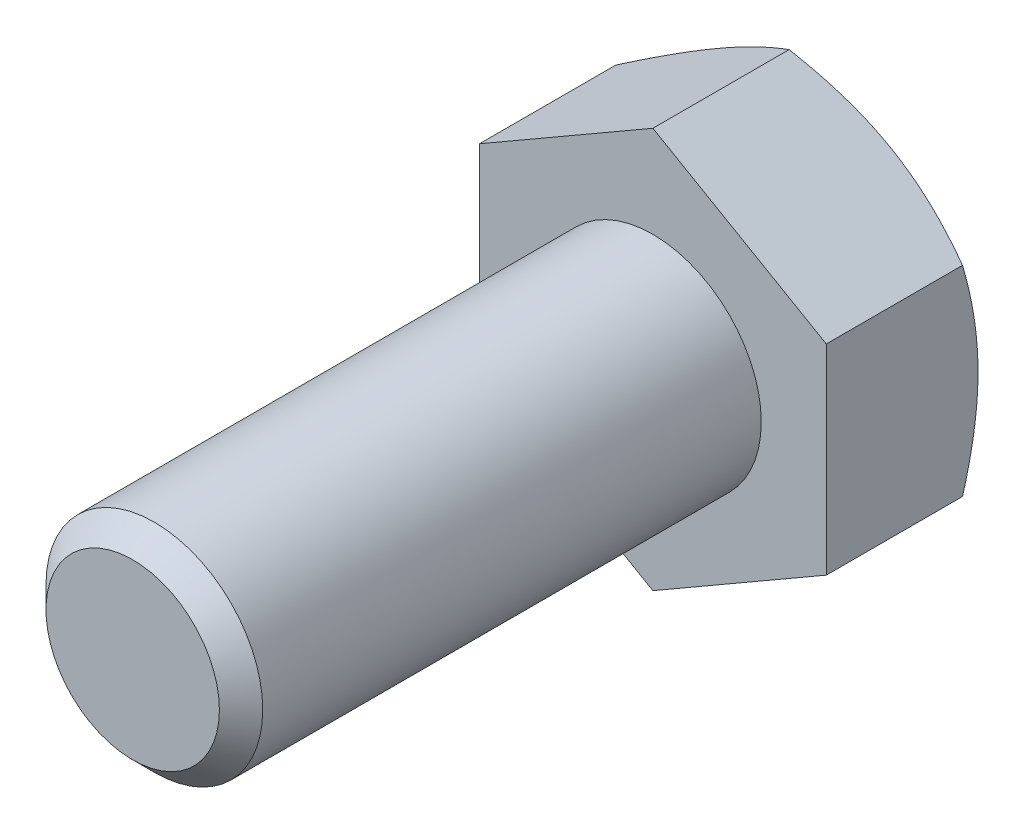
ISO-10303-21;
HEADER;
FILE_DESCRIPTION(('STEP AP214'),'2;1');
FILE_NAME('part.step','',(''),(''),'','','');
FILE_SCHEMA(('AUTOMOTIVE_DESIGN { 1 0 10303 214 1 1 1 1 }'));
ENDSEC;
DATA;
#1=APPLICATION_CONTEXT('core data for automotive mechanical design processes');
#2=APPLICATION_PROTOCOL_DEFINITION('international standard','automotive_design',2000,#1);
#3=PRODUCT_CONTEXT('',#1,'mechanical');
#4=PRODUCT('Part','Part','',(#3));
#5=PRODUCT_RELATED_PRODUCT_CATEGORY('part','',(#4));
#6=PRODUCT_DEFINITION_FORMATION('','',#4);
#7=PRODUCT_DEFINITION_CONTEXT('part definition',#1,'design');
#8=PRODUCT_DEFINITION('design','',#6,#7);
#9=PRODUCT_DEFINITION_SHAPE('','',#8);
#10=(LENGTH_UNIT() NAMED_UNIT(*) SI_UNIT(.MILLI.,.METRE.));
#11=(NAMED_UNIT(*) PLANE_ANGLE_UNIT() SI_UNIT($,.RADIAN.));
#12=(NAMED_UNIT(*) SI_UNIT($,.STERADIAN.) SOLID_ANGLE_UNIT());
#13=UNCERTAINTY_MEASURE_WITH_UNIT(LENGTH_MEASURE(1.E-05),#10,'distance_accuracy_value','');
#14=(GEOMETRIC_REPRESENTATION_CONTEXT(3) GLOBAL_UNCERTAINTY_ASSIGNED_CONTEXT((#13)) GLOBAL_UNIT_ASSIGNED_CONTEXT((#10,
#11,#12)) REPRESENTATION_CONTEXT('',''));
#15=CARTESIAN_POINT('',(0.,0.,0.));
#16=DIRECTION('',(0.,0.,1.));
#17=DIRECTION('',(1.,0.,0.));
#18=AXIS2_PLACEMENT_3D('',#15,#16,#17);
#19=CARTESIAN_POINT('',(0.,0.,12.));
#20=DIRECTION('',(0.,0.,1.));
#21=DIRECTION('',(1.,0.,0.));
#22=AXIS2_PLACEMENT_3D('',#19,#20,#21);
#23=PLANE('',#22);
#24=CARTESIAN_POINT('',(0.,0.,12.));
#25=DIRECTION('',(0.,0.,1.));
#26=DIRECTION('',(1.,0.,0.));
#27=AXIS2_PLACEMENT_3D('',#24,#25,#26);
#28=CIRCLE('',#27,2.);
#29=CARTESIAN_POINT('',(2.,0.,12.));
#30=VERTEX_POINT('',#29);
#31=EDGE_CURVE('E543',#30,#30,#28,.T.);
#32=ORIENTED_EDGE('',*,*,#31,.T.);
#33=EDGE_LOOP('',(#32));
#34=FACE_BOUND('',#33,.T.);
#35=ADVANCED_FACE('F369',(#34),#23,.T.);
#36=CARTESIAN_POINT('',(0.,0.,0.));
#37=DIRECTION('',(0.,0.,1.));
#38=DIRECTION('',(1.,0.,0.));
#39=AXIS2_PLACEMENT_3D('',#36,#37,#38);
#40=CYLINDRICAL_SURFACE('',#39,2.5);
#41=CARTESIAN_POINT('',(0.,0.,11.5));
#42=DIRECTION('',(0.,0.,1.));
#43=DIRECTION('',(1.,0.,0.));
#44=AXIS2_PLACEMENT_3D('',#41,#42,#43);
#45=CIRCLE('',#44,2.5);
#46=CARTESIAN_POINT('',(2.5,0.,11.5));
#47=VERTEX_POINT('',#46);
#48=EDGE_CURVE('E545',#47,#47,#45,.F.);
#49=ORIENTED_EDGE('',*,*,#48,.T.);
#50=EDGE_LOOP('',(#49));
#51=FACE_BOUND('',#50,.T.);
#52=CARTESIAN_POINT('',(0.,0.,0.));
#53=DIRECTION('',(0.,0.,1.));
#54=DIRECTION('',(1.,0.,0.));
#55=AXIS2_PLACEMENT_3D('',#52,#53,#54);
#56=CIRCLE('',#55,2.5);
#57=CARTESIAN_POINT('',(2.5,0.,0.));
#58=VERTEX_POINT('',#57);
#59=EDGE_CURVE('E546',#58,#58,#56,.F.);
#60=ORIENTED_EDGE('',*,*,#59,.F.);
#61=EDGE_LOOP('',(#60));
#62=FACE_BOUND('',#61,.T.);
#63=ADVANCED_FACE('F534',(#51,#62),#40,.T.);
#64=CARTESIAN_POINT('',(0.,0.,12.));
#65=DIRECTION('',(0.,0.,-1.));
#66=DIRECTION('',(-1.,0.,0.));
#67=AXIS2_PLACEMENT_3D('',#64,#65,#66);
#68=CONICAL_SURFACE('',#67,2.,0.785398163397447);
#69=ORIENTED_EDGE('',*,*,#48,.F.);
#70=EDGE_LOOP('',(#69));
#71=FACE_BOUND('',#70,.T.);
#72=ORIENTED_EDGE('',*,*,#31,.F.);
#73=EDGE_LOOP('',(#72));
#74=FACE_BOUND('',#73,.T.);
#75=ADVANCED_FACE('F539',(#71,#74),#68,.T.);
#76=CARTESIAN_POINT('',(0.,4.61880215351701,-3.5));
#77=DIRECTION('',(0.499999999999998,0.86602540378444,0.));
#78=DIRECTION('',(-0.86602540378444,0.499999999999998,0.));
#79=AXIS2_PLACEMENT_3D('',#76,#77,#78);
#80=PLANE('',#79);
#81=CARTESIAN_POINT('',(-0.000200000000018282,4.61891762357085,-3.14266774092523));
#82=CARTESIAN_POINT('',(0.17557915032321,4.51743148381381,-3.20128212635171));
#83=CARTESIAN_POINT('',(0.352875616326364,4.41506932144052,-3.25458967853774));
#84=CARTESIAN_POINT('',(0.710538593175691,4.2085725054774,-3.3476383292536));
#85=CARTESIAN_POINT('',(0.890911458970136,4.10443418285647,-3.3873465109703));
#86=CARTESIAN_POINT('',(1.24942181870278,3.89744813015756,-3.44915778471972));
#87=CARTESIAN_POINT('',(1.42750415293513,3.7946322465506,-3.47167226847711));
#88=CARTESIAN_POINT('',(1.7845067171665,3.58851671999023,-3.49854937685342));
#89=CARTESIAN_POINT('',(1.96342564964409,3.48521782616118,-3.50293425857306));
#90=CARTESIAN_POINT('',(2.29774284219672,3.29219970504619,-3.49380992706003));
#91=CARTESIAN_POINT('',(2.45319115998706,3.20245157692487,-3.48254104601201));
#92=CARTESIAN_POINT('',(2.76307505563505,3.02354002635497,-3.44682600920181));
#93=CARTESIAN_POINT('',(2.91750956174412,2.93437722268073,-3.42236765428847));
#94=CARTESIAN_POINT('',(3.22803232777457,2.75509682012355,-3.36122393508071));
#95=CARTESIAN_POINT('',(3.3840812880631,2.66500191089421,-3.32427939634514));
#96=CARTESIAN_POINT('',(3.69385183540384,2.48615580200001,-3.24042992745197));
#97=CARTESIAN_POINT('',(3.84757739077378,2.39740231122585,-3.19354469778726));
#98=CARTESIAN_POINT('',(4.0002,2.30928560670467,-3.14266774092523));
#99=B_SPLINE_CURVE_WITH_KNOTS('',3,(#81,#82,#83,#84,#85,#86,#87,#88,#89,#90,#91,#92,#93,#94,#95,
#96,#97,#98),.UNSPECIFIED.,.F.,.F.,(4,2,2,2,2,2,2,2,4),(0.,0.634047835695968,1.26961969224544,
1.88946157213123,2.50854226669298,3.04757825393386,3.58711366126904,4.13861653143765,
4.68903648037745),.UNSPECIFIED.);
#100=CARTESIAN_POINT('',(0.,4.61880215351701,-3.14273441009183));
#101=VERTEX_POINT('',#100);
#102=CARTESIAN_POINT('',(1.99999999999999,3.46410161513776,-3.5));
#103=VERTEX_POINT('',#102);
#104=EDGE_CURVE('E579',#101,#103,#99,.T.);
#105=ORIENTED_EDGE('',*,*,#104,.F.);
#106=DIRECTION('',(0.,0.,1.));
#107=VECTOR('',#106,1.);
#108=CARTESIAN_POINT('',(0.,4.61880215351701,-3.5));
#109=LINE('',#108,#107);
#110=CARTESIAN_POINT('',(0.,4.61880215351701,0.));
#111=VERTEX_POINT('',#110);
#112=EDGE_CURVE('E553',#101,#111,#109,.T.);
#113=ORIENTED_EDGE('',*,*,#112,.T.);
#114=DIRECTION('',(-0.86602540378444,0.499999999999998,0.));
#115=VECTOR('',#114,1.);
#116=CARTESIAN_POINT('',(0.,4.61880215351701,0.));
#117=LINE('',#116,#115);
#118=CARTESIAN_POINT('',(4.,2.30940107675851,0.));
#119=VERTEX_POINT('',#118);
#120=EDGE_CURVE('E577',#119,#111,#117,.T.);
#121=ORIENTED_EDGE('',*,*,#120,.F.);
#122=DIRECTION('',(0.,0.,1.));
#123=VECTOR('',#122,1.);
#124=CARTESIAN_POINT('',(4.,2.30940107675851,-3.5));
#125=LINE('',#124,#123);
#126=CARTESIAN_POINT('',(4.,2.30940107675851,-3.14273441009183));
#127=VERTEX_POINT('',#126);
#128=EDGE_CURVE('E550',#127,#119,#125,.T.);
#129=ORIENTED_EDGE('',*,*,#128,.F.);
#130=EDGE_CURVE('E509',#103,#127,#99,.T.);
#131=ORIENTED_EDGE('',*,*,#130,.F.);
#132=EDGE_LOOP('',(#105,#113,#121,#129,#131));
#133=FACE_BOUND('',#132,.T.);
#134=ADVANCED_FACE('F519',(#133),#80,.T.);
#135=CARTESIAN_POINT('',(4.,-2.30940107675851,-3.5));
#136=DIRECTION('',(1.,0.,0.));
#137=DIRECTION('',(0.,0.,-1.));
#138=AXIS2_PLACEMENT_3D('',#135,#136,#137);
#139=PLANE('',#138);
#140=CARTESIAN_POINT('',(4.,-6.3201620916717,-1.49105074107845));
#141=CARTESIAN_POINT('',(4.,-6.14442149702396,-1.57676392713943));
#142=CARTESIAN_POINT('',(4.,-5.96828976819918,-1.66168830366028));
#143=CARTESIAN_POINT('',(4.,-5.61503642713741,-1.82951794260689));
#144=CARTESIAN_POINT('',(4.,-5.43791467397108,-1.91242290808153));
#145=CARTESIAN_POINT('',(4.,-5.08161610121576,-2.07616457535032));
#146=CARTESIAN_POINT('',(4.,-4.90243340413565,-2.15698853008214));
#147=CARTESIAN_POINT('',(4.,-4.54268290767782,-2.31548071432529));
#148=CARTESIAN_POINT('',(4.,-4.36211517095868,-2.3931490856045));
#149=CARTESIAN_POINT('',(4.,-3.99309046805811,-2.54709429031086));
#150=CARTESIAN_POINT('',(4.,-3.80457523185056,-2.62323217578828));
#151=CARTESIAN_POINT('',(4.,-3.42538286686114,-2.77002330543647));
#152=CARTESIAN_POINT('',(4.,-3.23470550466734,-2.84067595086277));
#153=CARTESIAN_POINT('',(4.,-2.85120603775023,-2.9747272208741));
#154=CARTESIAN_POINT('',(4.,-2.65838877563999,-3.03813956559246));
#155=CARTESIAN_POINT('',(4.,-2.26999073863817,-3.15575322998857));
#156=CARTESIAN_POINT('',(4.,-2.07441081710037,-3.2099573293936));
#157=CARTESIAN_POINT('',(4.,-1.68146389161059,-3.30634238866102));
#158=CARTESIAN_POINT('',(4.,-1.48411388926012,-3.34859141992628));
#159=CARTESIAN_POINT('',(4.,-1.08684206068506,-3.41875684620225));
#160=CARTESIAN_POINT('',(4.,-0.886920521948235,-3.44667482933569));
#161=CARTESIAN_POINT('',(4.,-0.488161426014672,-3.48559194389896));
#162=CARTESIAN_POINT('',(4.,-0.289346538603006,-3.49681761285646));
#163=CARTESIAN_POINT('',(4.,0.108530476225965,-3.5020027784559));
#164=CARTESIAN_POINT('',(4.,0.307592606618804,-3.49596206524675));
#165=CARTESIAN_POINT('',(4.,0.642130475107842,-3.47173841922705));
#166=CARTESIAN_POINT('',(4.,0.777947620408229,-3.45796321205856));
#167=CARTESIAN_POINT('',(4.,1.04865722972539,-3.42317125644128));
#168=CARTESIAN_POINT('',(4.,1.18354957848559,-3.4021536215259));
#169=CARTESIAN_POINT('',(4.,1.58661718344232,-3.32933470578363));
#170=CARTESIAN_POINT('',(4.,1.85305348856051,-3.2677780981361));
#171=CARTESIAN_POINT('',(4.,2.25169312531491,-3.16013293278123));
#172=CARTESIAN_POINT('',(4.,2.38593642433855,-3.12116080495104));
#173=CARTESIAN_POINT('',(4.,2.65312122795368,-3.03894486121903));
#174=CARTESIAN_POINT('',(4.,2.78606272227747,-2.99570101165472));
#175=CARTESIAN_POINT('',(4.,3.05068341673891,-2.90565399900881));
#176=CARTESIAN_POINT('',(4.,3.18236294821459,-2.8588518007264));
#177=CARTESIAN_POINT('',(4.,3.44461473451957,-2.76226098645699));
#178=CARTESIAN_POINT('',(4.,3.57518701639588,-2.71247244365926));
#179=CARTESIAN_POINT('',(4.,3.93177798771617,-2.57257226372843));
#180=CARTESIAN_POINT('',(4.,4.15680215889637,-2.47992787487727));
#181=CARTESIAN_POINT('',(4.,4.60447894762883,-2.28905562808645));
#182=CARTESIAN_POINT('',(4.,4.82713127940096,-2.19082710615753));
#183=CARTESIAN_POINT('',(4.,5.27061186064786,-1.99013448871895));
#184=CARTESIAN_POINT('',(4.,5.49143940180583,-1.88766883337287));
#185=CARTESIAN_POINT('',(4.,5.93157734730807,-1.67952247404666));
#186=CARTESIAN_POINT('',(4.,6.15088770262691,-1.57384166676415));
#187=CARTESIAN_POINT('',(4.,6.58864452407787,-1.35980684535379));
#188=CARTESIAN_POINT('',(4.,6.80708897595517,-1.25144872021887));
#189=CARTESIAN_POINT('',(4.,7.24298360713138,-1.03274864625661));
#190=CARTESIAN_POINT('',(4.,7.46043377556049,-0.922406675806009));
#191=CARTESIAN_POINT('',(4.,8.11147090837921,-0.589073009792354));
#192=CARTESIAN_POINT('',(4.,8.5438492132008,-0.363721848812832));
#193=CARTESIAN_POINT('',(4.,9.35956992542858,0.0664624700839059));
#194=CARTESIAN_POINT('',(4.,9.74313951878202,0.270866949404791));
#195=CARTESIAN_POINT('',(4.,10.5090013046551,0.68211422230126));
#196=CARTESIAN_POINT('',(4.,10.891293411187,0.888957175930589));
#197=CARTESIAN_POINT('',(4.,11.6535663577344,1.30371780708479));
#198=CARTESIAN_POINT('',(4.,12.0335506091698,1.51162922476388));
#199=CARTESIAN_POINT('',(4.,12.7927224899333,1.928827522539));
#200=CARTESIAN_POINT('',(4.,13.1719101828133,2.13811428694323));
#201=CARTESIAN_POINT('',(4.,13.5508195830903,2.34790058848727));
#202=B_SPLINE_CURVE_WITH_KNOTS('',3,(#140,#141,#142,#143,#144,#145,#146,#147,#148,#149,#150,
#151,#152,#153,#154,#155,#156,#157,#158,#159,#160,#161,#162,#163,#164,#165,#166,#167,#168,#169,
#170,#171,#172,#173,#174,#175,#176,#177,#178,#179,#180,#181,#182,#183,#184,#185,#186,#187,#188,
#189,#190,#191,#192,#193,#194,#195,#196,#197,#198,#199,#200,#201),.UNSPECIFIED.,.F.,.F.,(4,2,2,
2,2,2,2,2,2,2,2,2,2,2,2,2,2,2,2,2,2,2,2,2,2,2,2,2,2,2,4),(0.,0.58659299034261,1.17327172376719,
1.76295108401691,2.35260392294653,2.96246799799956,3.57239854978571,4.18115341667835,
4.78972418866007,5.39475667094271,5.99972209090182,6.59639988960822,7.19308494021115,
7.60243041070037,8.01182600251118,8.83100524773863,9.25032401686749,9.66964609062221,
10.0888548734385,10.5080533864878,11.2379871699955,11.9680079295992,12.6982998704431,
13.4286153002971,14.1601319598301,14.8916565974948,16.354355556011,17.6582490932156,
18.9622286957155,20.261662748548,21.5609888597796),.UNSPECIFIED.);
#203=CARTESIAN_POINT('',(4.,0.,-3.5));
#204=VERTEX_POINT('',#203);
#205=EDGE_CURVE('E507',#127,#204,#202,.F.);
#206=ORIENTED_EDGE('',*,*,#205,.F.);
#207=ORIENTED_EDGE('',*,*,#128,.T.);
#208=DIRECTION('',(0.,1.,0.));
#209=VECTOR('',#208,1.);
#210=CARTESIAN_POINT('',(4.,-2.30940107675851,0.));
#211=LINE('',#210,#209);
#212=CARTESIAN_POINT('',(4.,-2.30940107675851,0.));
#213=VERTEX_POINT('',#212);
#214=EDGE_CURVE('E555',#213,#119,#211,.T.);
#215=ORIENTED_EDGE('',*,*,#214,.F.);
#216=DIRECTION('',(0.,0.,1.));
#217=VECTOR('',#216,1.);
#218=CARTESIAN_POINT('',(4.,-2.30940107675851,-3.5));
#219=LINE('',#218,#217);
#220=CARTESIAN_POINT('',(4.,-2.30940107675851,-3.14273441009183));
#221=VERTEX_POINT('',#220);
#222=EDGE_CURVE('E561',#221,#213,#219,.T.);
#223=ORIENTED_EDGE('',*,*,#222,.F.);
#224=EDGE_CURVE('E502',#204,#221,#202,.F.);
#225=ORIENTED_EDGE('',*,*,#224,.F.);
#226=EDGE_LOOP('',(#206,#207,#215,#223,#225));
#227=FACE_BOUND('',#226,.T.);
#228=ADVANCED_FACE('F515',(#227),#139,.T.);
#229=CARTESIAN_POINT('',(0.,-4.61880215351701,-3.5));
#230=DIRECTION('',(0.499999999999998,-0.86602540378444,0.));
#231=DIRECTION('',(0.86602540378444,0.499999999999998,0.));
#232=AXIS2_PLACEMENT_3D('',#229,#230,#231);
#233=PLANE('',#232);
#234=CARTESIAN_POINT('',(4.0002,-2.30928560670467,-3.14266774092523));
#235=CARTESIAN_POINT('',(3.82442084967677,-2.41077174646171,-3.20128212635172));
#236=CARTESIAN_POINT('',(3.64712438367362,-2.513133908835,-3.25458967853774));
#237=CARTESIAN_POINT('',(3.28946140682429,-2.71963072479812,-3.3476383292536));
#238=CARTESIAN_POINT('',(3.10908854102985,-2.82376904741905,-3.3873465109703));
#239=CARTESIAN_POINT('',(2.75057818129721,-3.03075510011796,-3.44915778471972));
#240=CARTESIAN_POINT('',(2.57249584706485,-3.13357098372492,-3.47167226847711));
#241=CARTESIAN_POINT('',(2.21549328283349,-3.33968651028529,-3.49854937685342));
#242=CARTESIAN_POINT('',(2.03657435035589,-3.44298540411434,-3.50293425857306));
#243=CARTESIAN_POINT('',(1.70225715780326,-3.63600352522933,-3.49380992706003));
#244=CARTESIAN_POINT('',(1.54680884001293,-3.72575165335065,-3.48254104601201));
#245=CARTESIAN_POINT('',(1.23692494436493,-3.90466320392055,-3.44682600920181));
#246=CARTESIAN_POINT('',(1.08249043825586,-3.99382600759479,-3.42236765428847));
#247=CARTESIAN_POINT('',(0.771967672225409,-4.17310641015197,-3.36122393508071));
#248=CARTESIAN_POINT('',(0.615918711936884,-4.26320131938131,-3.32427939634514));
#249=CARTESIAN_POINT('',(0.306148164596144,-4.44204742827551,-3.24042992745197));
#250=CARTESIAN_POINT('',(0.152422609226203,-4.53080091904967,-3.19354469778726));
#251=CARTESIAN_POINT('',(-0.000200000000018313,-4.61891762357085,-3.14266774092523));
#252=B_SPLINE_CURVE_WITH_KNOTS('',3,(#234,#235,#236,#237,#238,#239,#240,#241,#242,#243,#244,
#245,#246,#247,#248,#249,#250,#251),.UNSPECIFIED.,.F.,.F.,(4,2,2,2,2,2,2,2,4),(0.,
0.634047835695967,1.26961969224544,1.88946157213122,2.50854226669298,3.04757825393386,
3.58711366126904,4.13861653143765,4.68903648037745),.UNSPECIFIED.);
#253=CARTESIAN_POINT('',(1.99999999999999,-3.46410161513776,-3.5));
#254=VERTEX_POINT('',#253);
#255=EDGE_CURVE('E508',#221,#254,#252,.T.);
#256=ORIENTED_EDGE('',*,*,#255,.F.);
#257=ORIENTED_EDGE('',*,*,#222,.T.);
#258=DIRECTION('',(0.86602540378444,0.499999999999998,0.));
#259=VECTOR('',#258,1.);
#260=CARTESIAN_POINT('',(0.,-4.61880215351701,0.));
#261=LINE('',#260,#259);
#262=CARTESIAN_POINT('',(0.,-4.61880215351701,0.));
#263=VERTEX_POINT('',#262);
#264=EDGE_CURVE('E566',#263,#213,#261,.T.);
#265=ORIENTED_EDGE('',*,*,#264,.F.);
#266=DIRECTION('',(0.,0.,1.));
#267=VECTOR('',#266,1.);
#268=CARTESIAN_POINT('',(0.,-4.61880215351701,-3.5));
#269=LINE('',#268,#267);
#270=CARTESIAN_POINT('',(0.,-4.61880215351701,-3.14273441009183));
#271=VERTEX_POINT('',#270);
#272=EDGE_CURVE('E559',#271,#263,#269,.T.);
#273=ORIENTED_EDGE('',*,*,#272,.F.);
#274=EDGE_CURVE('E496',#254,#271,#252,.T.);
#275=ORIENTED_EDGE('',*,*,#274,.F.);
#276=EDGE_LOOP('',(#256,#257,#265,#273,#275));
#277=FACE_BOUND('',#276,.T.);
#278=ADVANCED_FACE('F518',(#277),#233,.T.);
#279=CARTESIAN_POINT('',(0.,-4.61880215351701,-3.5));
#280=DIRECTION('',(-0.500000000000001,-0.866025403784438,0.));
#281=DIRECTION('',(0.866025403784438,-0.500000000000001,0.));
#282=AXIS2_PLACEMENT_3D('',#279,#280,#281);
#283=PLANE('',#282);
#284=CARTESIAN_POINT('',(0.000199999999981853,-4.61891762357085,-3.14266774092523));
#285=CARTESIAN_POINT('',(-0.175579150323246,-4.51743148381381,-3.20128212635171));
#286=CARTESIAN_POINT('',(-0.352875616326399,-4.41506932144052,-3.25458967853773));
#287=CARTESIAN_POINT('',(-0.710538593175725,-4.2085725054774,-3.34763832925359));
#288=CARTESIAN_POINT('',(-0.89091145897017,-4.10443418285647,-3.38734651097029));
#289=CARTESIAN_POINT('',(-1.24942181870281,-3.89744813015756,-3.44915778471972));
#290=CARTESIAN_POINT('',(-1.42750415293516,-3.79463224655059,-3.47167226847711));
#291=CARTESIAN_POINT('',(-1.78450671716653,-3.58851671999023,-3.49854937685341));
#292=CARTESIAN_POINT('',(-1.96342564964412,-3.48521782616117,-3.50293425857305));
#293=CARTESIAN_POINT('',(-2.29774284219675,-3.29219970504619,-3.49380992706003));
#294=CARTESIAN_POINT('',(-2.45319115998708,-3.20245157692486,-3.482541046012));
#295=CARTESIAN_POINT('',(-2.76307505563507,-3.02354002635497,-3.4468260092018));
#296=CARTESIAN_POINT('',(-2.91750956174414,-2.93437722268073,-3.42236765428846));
#297=CARTESIAN_POINT('',(-3.22803232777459,-2.75509682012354,-3.36122393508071));
#298=CARTESIAN_POINT('',(-3.38408128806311,-2.6650019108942,-3.32427939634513));
#299=CARTESIAN_POINT('',(-3.69385183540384,-2.48615580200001,-3.24042992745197));
#300=CARTESIAN_POINT('',(-3.84757739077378,-2.39740231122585,-3.19354469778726));
#301=CARTESIAN_POINT('',(-4.0002,-2.30928560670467,-3.14266774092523));
#302=B_SPLINE_CURVE_WITH_KNOTS('',3,(#284,#285,#286,#287,#288,#289,#290,#291,#292,#293,#294,
#295,#296,#297,#298,#299,#300,#301),.UNSPECIFIED.,.F.,.F.,(4,2,2,2,2,2,2,2,4),(0.,
0.634047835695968,1.26961969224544,1.88946157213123,2.50854226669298,3.04757825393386,
3.58711366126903,4.13861653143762,4.68903648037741),.UNSPECIFIED.);
#303=CARTESIAN_POINT('',(-2.,-3.46410161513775,-3.5));
#304=VERTEX_POINT('',#303);
#305=EDGE_CURVE('E598',#271,#304,#302,.T.);
#306=ORIENTED_EDGE('',*,*,#305,.F.);
#307=ORIENTED_EDGE('',*,*,#272,.T.);
#308=DIRECTION('',(0.866025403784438,-0.500000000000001,0.));
#309=VECTOR('',#308,1.);
#310=CARTESIAN_POINT('',(0.,-4.61880215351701,0.));
#311=LINE('',#310,#309);
#312=CARTESIAN_POINT('',(-4.,-2.30940107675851,0.));
#313=VERTEX_POINT('',#312);
#314=EDGE_CURVE('E569',#313,#263,#311,.T.);
#315=ORIENTED_EDGE('',*,*,#314,.F.);
#316=DIRECTION('',(0.,0.,1.));
#317=VECTOR('',#316,1.);
#318=CARTESIAN_POINT('',(-4.,-2.30940107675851,-3.5));
#319=LINE('',#318,#317);
#320=CARTESIAN_POINT('',(-4.,-2.30940107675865,-3.14273441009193));
#321=VERTEX_POINT('',#320);
#322=EDGE_CURVE('E557',#321,#313,#319,.T.);
#323=ORIENTED_EDGE('',*,*,#322,.F.);
#324=EDGE_CURVE('E445',#304,#321,#302,.T.);
#325=ORIENTED_EDGE('',*,*,#324,.F.);
#326=EDGE_LOOP('',(#306,#307,#315,#323,#325));
#327=FACE_BOUND('',#326,.T.);
#328=ADVANCED_FACE('F523',(#327),#283,.T.);
#329=CARTESIAN_POINT('',(-4.,-2.30940107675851,-3.5));
#330=DIRECTION('',(-1.,0.,0.));
#331=DIRECTION('',(0.,0.,1.));
#332=AXIS2_PLACEMENT_3D('',#329,#330,#331);
#333=PLANE('',#332);
#334=CARTESIAN_POINT('',(-4.,-6.3201620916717,-1.49105074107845));
#335=CARTESIAN_POINT('',(-4.,-6.14442149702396,-1.57676392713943));
#336=CARTESIAN_POINT('',(-4.,-5.96828976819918,-1.66168830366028));
#337=CARTESIAN_POINT('',(-4.,-5.61503642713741,-1.82951794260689));
#338=CARTESIAN_POINT('',(-4.,-5.43791467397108,-1.91242290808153));
#339=CARTESIAN_POINT('',(-4.,-5.08161610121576,-2.07616457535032));
#340=CARTESIAN_POINT('',(-4.,-4.90243340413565,-2.15698853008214));
#341=CARTESIAN_POINT('',(-4.,-4.54268290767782,-2.31548071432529));
#342=CARTESIAN_POINT('',(-4.,-4.36211517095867,-2.3931490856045));
#343=CARTESIAN_POINT('',(-4.,-3.99309046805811,-2.54709429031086));
#344=CARTESIAN_POINT('',(-4.,-3.80457523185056,-2.62323217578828));
#345=CARTESIAN_POINT('',(-4.,-3.42538286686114,-2.77002330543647));
#346=CARTESIAN_POINT('',(-4.,-3.23470550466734,-2.84067595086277));
#347=CARTESIAN_POINT('',(-4.,-2.85120603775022,-2.9747272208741));
#348=CARTESIAN_POINT('',(-4.,-2.65838877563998,-3.03813956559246));
#349=CARTESIAN_POINT('',(-4.,-2.26999073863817,-3.15575322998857));
#350=CARTESIAN_POINT('',(-4.,-2.07441081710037,-3.2099573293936));
#351=CARTESIAN_POINT('',(-4.,-1.68146389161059,-3.30634238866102));
#352=CARTESIAN_POINT('',(-4.,-1.48411388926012,-3.34859141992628));
#353=CARTESIAN_POINT('',(-4.,-1.08684206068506,-3.41875684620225));
#354=CARTESIAN_POINT('',(-4.,-0.886920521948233,-3.44667482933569));
#355=CARTESIAN_POINT('',(-4.,-0.488161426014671,-3.48559194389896));
#356=CARTESIAN_POINT('',(-4.,-0.289346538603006,-3.49681761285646));
#357=CARTESIAN_POINT('',(-4.,0.108530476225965,-3.5020027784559));
#358=CARTESIAN_POINT('',(-4.,0.307592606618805,-3.49596206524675));
#359=CARTESIAN_POINT('',(-4.,0.642130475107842,-3.47173841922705));
#360=CARTESIAN_POINT('',(-4.,0.777947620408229,-3.45796321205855));
#361=CARTESIAN_POINT('',(-4.,1.04865722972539,-3.42317125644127));
#362=CARTESIAN_POINT('',(-4.,1.18354957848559,-3.4021536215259));
#363=CARTESIAN_POINT('',(-4.,1.58661718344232,-3.32933470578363));
#364=CARTESIAN_POINT('',(-4.,1.8530534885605,-3.2677780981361));
#365=CARTESIAN_POINT('',(-4.,2.2516931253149,-3.16013293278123));
#366=CARTESIAN_POINT('',(-4.,2.38593642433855,-3.12116080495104));
#367=CARTESIAN_POINT('',(-4.,2.65312122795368,-3.03894486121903));
#368=CARTESIAN_POINT('',(-4.,2.78606272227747,-2.99570101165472));
#369=CARTESIAN_POINT('',(-4.,3.05068341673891,-2.90565399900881));
#370=CARTESIAN_POINT('',(-4.,3.18236294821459,-2.8588518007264));
#371=CARTESIAN_POINT('',(-4.,3.44461473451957,-2.76226098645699));
#372=CARTESIAN_POINT('',(-4.,3.57518701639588,-2.71247244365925));
#373=CARTESIAN_POINT('',(-4.,3.93177798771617,-2.57257226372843));
#374=CARTESIAN_POINT('',(-4.,4.15680215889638,-2.47992787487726));
#375=CARTESIAN_POINT('',(-4.,4.60447894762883,-2.28905562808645));
#376=CARTESIAN_POINT('',(-4.,4.82713127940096,-2.19082710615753));
#377=CARTESIAN_POINT('',(-4.,5.27061186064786,-1.99013448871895));
#378=CARTESIAN_POINT('',(-4.,5.49143940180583,-1.88766883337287));
#379=CARTESIAN_POINT('',(-4.,5.93157734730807,-1.67952247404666));
#380=CARTESIAN_POINT('',(-4.,6.15088770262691,-1.57384166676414));
#381=CARTESIAN_POINT('',(-4.,6.58864452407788,-1.35980684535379));
#382=CARTESIAN_POINT('',(-4.,6.80708897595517,-1.25144872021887));
#383=CARTESIAN_POINT('',(-4.,7.24298360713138,-1.03274864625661));
#384=CARTESIAN_POINT('',(-4.,7.46043377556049,-0.922406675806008));
#385=CARTESIAN_POINT('',(-4.,8.11147090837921,-0.589073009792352));
#386=CARTESIAN_POINT('',(-4.,8.5438492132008,-0.363721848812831));
#387=CARTESIAN_POINT('',(-4.,9.35956992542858,0.066462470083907));
#388=CARTESIAN_POINT('',(-4.,9.74313951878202,0.270866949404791));
#389=CARTESIAN_POINT('',(-4.,10.5090013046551,0.68211422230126));
#390=CARTESIAN_POINT('',(-4.,10.891293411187,0.888957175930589));
#391=CARTESIAN_POINT('',(-4.,11.6535663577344,1.30371780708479));
#392=CARTESIAN_POINT('',(-4.,12.0335506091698,1.51162922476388));
#393=CARTESIAN_POINT('',(-4.,12.7927224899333,1.928827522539));
#394=CARTESIAN_POINT('',(-4.,13.1719101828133,2.13811428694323));
#395=CARTESIAN_POINT('',(-4.,13.5508195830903,2.34790058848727));
#396=B_SPLINE_CURVE_WITH_KNOTS('',3,(#334,#335,#336,#337,#338,#339,#340,#341,#342,#343,#344,
#345,#346,#347,#348,#349,#350,#351,#352,#353,#354,#355,#356,#357,#358,#359,#360,#361,#362,#363,
#364,#365,#366,#367,#368,#369,#370,#371,#372,#373,#374,#375,#376,#377,#378,#379,#380,#381,#382,
#383,#384,#385,#386,#387,#388,#389,#390,#391,#392,#393,#394,#395),.UNSPECIFIED.,.F.,.F.,(4,2,2,
2,2,2,2,2,2,2,2,2,2,2,2,2,2,2,2,2,2,2,2,2,2,2,2,2,2,2,4),(0.,0.586592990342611,1.17327172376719,
1.76295108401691,2.35260392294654,2.96246799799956,3.57239854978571,4.18115341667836,
4.78972418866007,5.39475667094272,5.99972209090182,6.59639988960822,7.19308494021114,
7.60243041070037,8.01182600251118,8.83100524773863,9.25032401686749,9.66964609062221,
10.0888548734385,10.5080533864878,11.2379871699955,11.9680079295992,12.6982998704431,
13.4286153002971,14.1601319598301,14.8916565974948,16.354355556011,17.6582490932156,
18.9622286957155,20.261662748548,21.5609888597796),.UNSPECIFIED.);
#397=CARTESIAN_POINT('',(-4.,0.,-3.5));
#398=VERTEX_POINT('',#397);
#399=EDGE_CURVE('E440',#321,#398,#396,.T.);
#400=ORIENTED_EDGE('',*,*,#399,.F.);
#401=ORIENTED_EDGE('',*,*,#322,.T.);
#402=DIRECTION('',(0.,-1.,0.));
#403=VECTOR('',#402,1.);
#404=CARTESIAN_POINT('',(-4.,-2.30940107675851,0.));
#405=LINE('',#404,#403);
#406=CARTESIAN_POINT('',(-4.,2.30940107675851,0.));
#407=VERTEX_POINT('',#406);
#408=EDGE_CURVE('E572',#407,#313,#405,.T.);
#409=ORIENTED_EDGE('',*,*,#408,.F.);
#410=DIRECTION('',(0.,0.,1.));
#411=VECTOR('',#410,1.);
#412=CARTESIAN_POINT('',(-4.,2.30940107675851,-3.5));
#413=LINE('',#412,#411);
#414=CARTESIAN_POINT('',(-4.,2.30940107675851,-3.14273441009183));
#415=VERTEX_POINT('',#414);
#416=EDGE_CURVE('E466',#415,#407,#413,.T.);
#417=ORIENTED_EDGE('',*,*,#416,.F.);
#418=EDGE_CURVE('E449',#398,#415,#396,.T.);
#419=ORIENTED_EDGE('',*,*,#418,.F.);
#420=EDGE_LOOP('',(#400,#401,#409,#417,#419));
#421=FACE_BOUND('',#420,.T.);
#422=ADVANCED_FACE('F464',(#421),#333,.T.);
#423=CARTESIAN_POINT('',(-4.,2.30940107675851,-3.5));
#424=DIRECTION('',(-0.500000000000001,0.866025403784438,0.));
#425=DIRECTION('',(-0.866025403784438,-0.500000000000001,0.));
#426=AXIS2_PLACEMENT_3D('',#423,#424,#425);
#427=PLANE('',#426);
#428=CARTESIAN_POINT('',(-4.0002,2.30928560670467,-3.14266774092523));
#429=CARTESIAN_POINT('',(-3.82442084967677,2.41077174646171,-3.20128212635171));
#430=CARTESIAN_POINT('',(-3.64712438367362,2.513133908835,-3.25458967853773));
#431=CARTESIAN_POINT('',(-3.28946140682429,2.71963072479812,-3.34763832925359));
#432=CARTESIAN_POINT('',(-3.10908854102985,2.82376904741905,-3.38734651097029));
#433=CARTESIAN_POINT('',(-2.75057818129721,3.03075510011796,-3.44915778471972));
#434=CARTESIAN_POINT('',(-2.57249584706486,3.13357098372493,-3.47167226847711));
#435=CARTESIAN_POINT('',(-2.21549328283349,3.33968651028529,-3.49854937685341));
#436=CARTESIAN_POINT('',(-2.0365743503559,3.44298540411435,-3.50293425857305));
#437=CARTESIAN_POINT('',(-1.70225715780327,3.63600352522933,-3.49380992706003));
#438=CARTESIAN_POINT('',(-1.54680884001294,3.72575165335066,-3.482541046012));
#439=CARTESIAN_POINT('',(-1.23692494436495,3.90466320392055,-3.4468260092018));
#440=CARTESIAN_POINT('',(-1.08249043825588,3.99382600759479,-3.42236765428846));
#441=CARTESIAN_POINT('',(-0.771967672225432,4.17310641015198,-3.36122393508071));
#442=CARTESIAN_POINT('',(-0.61591871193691,4.26320131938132,-3.32427939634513));
#443=CARTESIAN_POINT('',(-0.306148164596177,4.44204742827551,-3.24042992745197));
#444=CARTESIAN_POINT('',(-0.152422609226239,4.53080091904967,-3.19354469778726));
#445=CARTESIAN_POINT('',(0.000199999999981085,4.61891762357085,-3.14266774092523));
#446=B_SPLINE_CURVE_WITH_KNOTS('',3,(#428,#429,#430,#431,#432,#433,#434,#435,#436,#437,#438,
#439,#440,#441,#442,#443,#444,#445),.UNSPECIFIED.,.F.,.F.,(4,2,2,2,2,2,2,2,4),(0.,
0.634047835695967,1.26961969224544,1.88946157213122,2.50854226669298,3.04757825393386,
3.58711366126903,4.13861653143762,4.68903648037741),.UNSPECIFIED.);
#447=CARTESIAN_POINT('',(-2.00000000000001,3.46410161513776,-3.5));
#448=VERTEX_POINT('',#447);
#449=EDGE_CURVE('E455',#415,#448,#446,.T.);
#450=ORIENTED_EDGE('',*,*,#449,.F.);
#451=ORIENTED_EDGE('',*,*,#416,.T.);
#452=DIRECTION('',(-0.866025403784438,-0.500000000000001,0.));
#453=VECTOR('',#452,1.);
#454=CARTESIAN_POINT('',(-4.,2.30940107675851,0.));
#455=LINE('',#454,#453);
#456=EDGE_CURVE('E575',#111,#407,#455,.T.);
#457=ORIENTED_EDGE('',*,*,#456,.F.);
#458=ORIENTED_EDGE('',*,*,#112,.F.);
#459=EDGE_CURVE('E457',#448,#101,#446,.T.);
#460=ORIENTED_EDGE('',*,*,#459,.F.);
#461=EDGE_LOOP('',(#450,#451,#457,#458,#460));
#462=FACE_BOUND('',#461,.T.);
#463=ADVANCED_FACE('F531',(#462),#427,.T.);
#464=CARTESIAN_POINT('',(4.,2.30940107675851,0.));
#465=DIRECTION('',(0.,0.,1.));
#466=DIRECTION('',(1.,0.,0.));
#467=AXIS2_PLACEMENT_3D('',#464,#465,#466);
#468=PLANE('',#467);
#469=ORIENTED_EDGE('',*,*,#59,.T.);
#470=EDGE_LOOP('',(#469));
#471=FACE_BOUND('',#470,.T.);
#472=ORIENTED_EDGE('',*,*,#120,.T.);
#473=ORIENTED_EDGE('',*,*,#456,.T.);
#474=ORIENTED_EDGE('',*,*,#408,.T.);
#475=ORIENTED_EDGE('',*,*,#314,.T.);
#476=ORIENTED_EDGE('',*,*,#264,.T.);
#477=ORIENTED_EDGE('',*,*,#214,.T.);
#478=EDGE_LOOP('',(#472,#473,#474,#475,#476,#477));
#479=FACE_BOUND('',#478,.T.);
#480=ADVANCED_FACE('F488',(#471,#479),#468,.T.);
#481=CARTESIAN_POINT('',(0.,0.,0.));
#482=DIRECTION('',(0.,0.,1.));
#483=DIRECTION('',(1.,0.,0.));
#484=AXIS2_PLACEMENT_3D('',#481,#482,#483);
#485=CONICAL_SURFACE('',#484,10.062177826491,1.0471975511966);
#486=ORIENTED_EDGE('',*,*,#130,.T.);
#487=ORIENTED_EDGE('',*,*,#205,.T.);
#488=CARTESIAN_POINT('',(0.,0.,-3.5));
#489=DIRECTION('',(0.,0.,1.));
#490=DIRECTION('',(1.,0.,0.));
#491=AXIS2_PLACEMENT_3D('',#488,#489,#490);
#492=CIRCLE('',#491,4.);
#493=EDGE_CURVE('E372',#103,#204,#492,.F.);
#494=ORIENTED_EDGE('',*,*,#493,.F.);
#495=EDGE_LOOP('',(#486,#487,#494));
#496=FACE_BOUND('',#495,.T.);
#497=ADVANCED_FACE('F588',(#496),#485,.T.);
#498=ORIENTED_EDGE('',*,*,#104,.T.);
#499=EDGE_CURVE('E462',#448,#103,#492,.F.);
#500=ORIENTED_EDGE('',*,*,#499,.F.);
#501=ORIENTED_EDGE('',*,*,#459,.T.);
#502=EDGE_LOOP('',(#498,#500,#501));
#503=FACE_BOUND('',#502,.T.);
#504=ADVANCED_FACE('F487',(#503),#485,.T.);
#505=ORIENTED_EDGE('',*,*,#418,.T.);
#506=ORIENTED_EDGE('',*,*,#449,.T.);
#507=CARTESIAN_POINT('',(0.,0.,-3.5));
#508=DIRECTION('',(0.,0.,-1.));
#509=DIRECTION('',(-1.,0.,0.));
#510=AXIS2_PLACEMENT_3D('',#507,#508,#509);
#511=CIRCLE('',#510,4.);
#512=EDGE_CURVE('E390',#398,#448,#511,.T.);
#513=ORIENTED_EDGE('',*,*,#512,.F.);
#514=EDGE_LOOP('',(#505,#506,#513));
#515=FACE_BOUND('',#514,.T.);
#516=ADVANCED_FACE('F453',(#515),#485,.T.);
#517=ORIENTED_EDGE('',*,*,#324,.T.);
#518=ORIENTED_EDGE('',*,*,#399,.T.);
#519=EDGE_CURVE('E442',#304,#398,#492,.F.);
#520=ORIENTED_EDGE('',*,*,#519,.F.);
#521=EDGE_LOOP('',(#517,#518,#520));
#522=FACE_BOUND('',#521,.T.);
#523=ADVANCED_FACE('F441',(#522),#485,.T.);
#524=ORIENTED_EDGE('',*,*,#274,.T.);
#525=ORIENTED_EDGE('',*,*,#305,.T.);
#526=EDGE_CURVE('E377',#254,#304,#492,.F.);
#527=ORIENTED_EDGE('',*,*,#526,.F.);
#528=EDGE_LOOP('',(#524,#525,#527));
#529=FACE_BOUND('',#528,.T.);
#530=ADVANCED_FACE('F600',(#529),#485,.T.);
#531=ORIENTED_EDGE('',*,*,#224,.T.);
#532=ORIENTED_EDGE('',*,*,#255,.T.);
#533=EDGE_CURVE('E11',#204,#254,#492,.F.);
#534=ORIENTED_EDGE('',*,*,#533,.F.);
#535=EDGE_LOOP('',(#531,#532,#534));
#536=FACE_BOUND('',#535,.T.);
#537=ADVANCED_FACE('F595',(#536),#485,.T.);
#538=CARTESIAN_POINT('',(4.,2.30940107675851,-3.5));
#539=DIRECTION('',(0.,0.,1.));
#540=DIRECTION('',(1.,0.,0.));
#541=AXIS2_PLACEMENT_3D('',#538,#539,#540);
#542=PLANE('',#541);
#543=ORIENTED_EDGE('',*,*,#493,.T.);
#544=ORIENTED_EDGE('',*,*,#533,.T.);
#545=ORIENTED_EDGE('',*,*,#526,.T.);
#546=ORIENTED_EDGE('',*,*,#519,.T.);
#547=ORIENTED_EDGE('',*,*,#512,.T.);
#548=ORIENTED_EDGE('',*,*,#499,.T.);
#549=EDGE_LOOP('',(#543,#544,#545,#546,#547,#548));
#550=FACE_BOUND('',#549,.T.);
#551=ADVANCED_FACE('F460',(#550),#542,.F.);
#552=CLOSED_SHELL('',(#35,#63,#75,#134,#228,#278,#328,#422,#463,#480,#497,#504,#516,#523,#530,
#537,#551));
#553=MANIFOLD_SOLID_BREP('B2',#552);
#554=ADVANCED_BREP_SHAPE_REPRESENTATION('',(#18,#553),#14);
#555=SHAPE_DEFINITION_REPRESENTATION(#9,#554);
ENDSEC;
END-ISO-10303-21;
